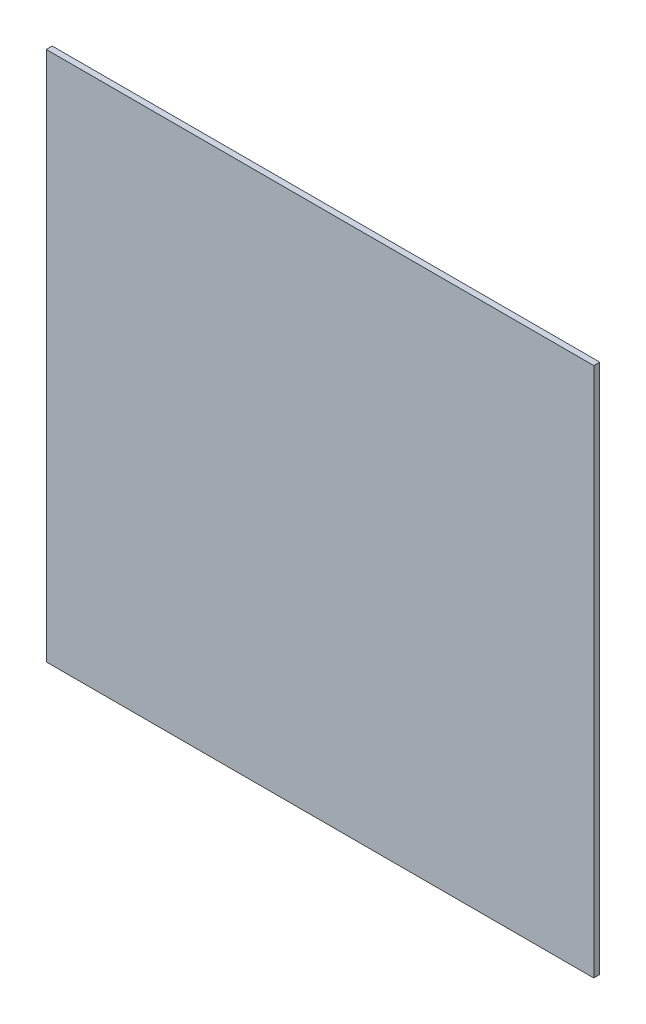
ISO-10303-21;
HEADER;
FILE_DESCRIPTION(('STEP AP214'),'2;1');
FILE_NAME('part.step','',(''),(''),'','','');
FILE_SCHEMA(('AUTOMOTIVE_DESIGN { 1 0 10303 214 1 1 1 1 }'));
ENDSEC;
DATA;
#1=APPLICATION_CONTEXT('core data for automotive mechanical design processes');
#2=APPLICATION_PROTOCOL_DEFINITION('international standard','automotive_design',2000,#1);
#3=PRODUCT_CONTEXT('',#1,'mechanical');
#4=PRODUCT('Part','Part','',(#3));
#5=PRODUCT_RELATED_PRODUCT_CATEGORY('part','',(#4));
#6=PRODUCT_DEFINITION_FORMATION('','',#4);
#7=PRODUCT_DEFINITION_CONTEXT('part definition',#1,'design');
#8=PRODUCT_DEFINITION('design','',#6,#7);
#9=PRODUCT_DEFINITION_SHAPE('','',#8);
#10=(LENGTH_UNIT() NAMED_UNIT(*) SI_UNIT(.MILLI.,.METRE.));
#11=(NAMED_UNIT(*) PLANE_ANGLE_UNIT() SI_UNIT($,.RADIAN.));
#12=(NAMED_UNIT(*) SI_UNIT($,.STERADIAN.) SOLID_ANGLE_UNIT());
#13=UNCERTAINTY_MEASURE_WITH_UNIT(LENGTH_MEASURE(1.E-05),#10,'distance_accuracy_value','');
#14=(GEOMETRIC_REPRESENTATION_CONTEXT(3) GLOBAL_UNCERTAINTY_ASSIGNED_CONTEXT((#13)) GLOBAL_UNIT_ASSIGNED_CONTEXT((#10,
#11,#12)) REPRESENTATION_CONTEXT('',''));
#15=CARTESIAN_POINT('',(0.,0.,0.));
#16=DIRECTION('',(0.,0.,1.));
#17=DIRECTION('',(1.,0.,0.));
#18=AXIS2_PLACEMENT_3D('',#15,#16,#17);
#19=CARTESIAN_POINT('',(48.,-46.5,1.05));
#20=DIRECTION('',(-1.,0.,0.));
#21=DIRECTION('',(0.,0.,1.));
#22=AXIS2_PLACEMENT_3D('',#19,#20,#21);
#23=PLANE('',#22);
#24=DIRECTION('',(0.,1.,0.));
#25=VECTOR('',#24,1.);
#26=CARTESIAN_POINT('',(48.,-46.5,0.));
#27=LINE('',#26,#25);
#28=CARTESIAN_POINT('',(48.,-46.5,0.));
#29=VERTEX_POINT('',#28);
#30=CARTESIAN_POINT('',(48.,46.5,0.));
#31=VERTEX_POINT('',#30);
#32=EDGE_CURVE('E98',#29,#31,#27,.T.);
#33=ORIENTED_EDGE('',*,*,#32,.T.);
#34=DIRECTION('',(0.,0.,-1.));
#35=VECTOR('',#34,1.);
#36=CARTESIAN_POINT('',(48.,46.5,1.05));
#37=LINE('',#36,#35);
#38=CARTESIAN_POINT('',(48.,46.5,1.05));
#39=VERTEX_POINT('',#38);
#40=EDGE_CURVE('E11',#39,#31,#37,.T.);
#41=ORIENTED_EDGE('',*,*,#40,.F.);
#42=DIRECTION('',(0.,1.,0.));
#43=VECTOR('',#42,1.);
#44=CARTESIAN_POINT('',(48.,-46.5,1.05));
#45=LINE('',#44,#43);
#46=CARTESIAN_POINT('',(48.,-46.5,1.05));
#47=VERTEX_POINT('',#46);
#48=EDGE_CURVE('E86',#47,#39,#45,.T.);
#49=ORIENTED_EDGE('',*,*,#48,.F.);
#50=DIRECTION('',(0.,0.,-1.));
#51=VECTOR('',#50,1.);
#52=CARTESIAN_POINT('',(48.,-46.5,1.05));
#53=LINE('',#52,#51);
#54=EDGE_CURVE('E94',#47,#29,#53,.T.);
#55=ORIENTED_EDGE('',*,*,#54,.T.);
#56=EDGE_LOOP('',(#33,#41,#49,#55));
#57=FACE_BOUND('',#56,.T.);
#58=ADVANCED_FACE('F35',(#57),#23,.F.);
#59=CARTESIAN_POINT('',(-48.,46.5,1.05));
#60=DIRECTION('',(0.,-1.,0.));
#61=DIRECTION('',(0.,0.,-1.));
#62=AXIS2_PLACEMENT_3D('',#59,#60,#61);
#63=PLANE('',#62);
#64=DIRECTION('',(-1.,0.,0.));
#65=VECTOR('',#64,1.);
#66=CARTESIAN_POINT('',(-48.,46.5,0.));
#67=LINE('',#66,#65);
#68=CARTESIAN_POINT('',(-48.,46.5,0.));
#69=VERTEX_POINT('',#68);
#70=EDGE_CURVE('E90',#31,#69,#67,.T.);
#71=ORIENTED_EDGE('',*,*,#70,.T.);
#72=DIRECTION('',(0.,0.,-1.));
#73=VECTOR('',#72,1.);
#74=CARTESIAN_POINT('',(-48.,46.5,1.05));
#75=LINE('',#74,#73);
#76=CARTESIAN_POINT('',(-48.,46.5,1.05));
#77=VERTEX_POINT('',#76);
#78=EDGE_CURVE('E43',#77,#69,#75,.T.);
#79=ORIENTED_EDGE('',*,*,#78,.F.);
#80=DIRECTION('',(-1.,0.,0.));
#81=VECTOR('',#80,1.);
#82=CARTESIAN_POINT('',(-48.,46.5,1.05));
#83=LINE('',#82,#81);
#84=EDGE_CURVE('E81',#39,#77,#83,.T.);
#85=ORIENTED_EDGE('',*,*,#84,.F.);
#86=ORIENTED_EDGE('',*,*,#40,.T.);
#87=EDGE_LOOP('',(#71,#79,#85,#86));
#88=FACE_BOUND('',#87,.T.);
#89=ADVANCED_FACE('F89',(#88),#63,.F.);
#90=CARTESIAN_POINT('',(-48.,-46.5,1.05));
#91=DIRECTION('',(1.,0.,0.));
#92=DIRECTION('',(0.,0.,-1.));
#93=AXIS2_PLACEMENT_3D('',#90,#91,#92);
#94=PLANE('',#93);
#95=DIRECTION('',(0.,-1.,0.));
#96=VECTOR('',#95,1.);
#97=CARTESIAN_POINT('',(-48.,-46.5,0.));
#98=LINE('',#97,#96);
#99=CARTESIAN_POINT('',(-48.,-46.5,0.));
#100=VERTEX_POINT('',#99);
#101=EDGE_CURVE('E68',#69,#100,#98,.T.);
#102=ORIENTED_EDGE('',*,*,#101,.T.);
#103=DIRECTION('',(0.,0.,-1.));
#104=VECTOR('',#103,1.);
#105=CARTESIAN_POINT('',(-48.,-46.5,1.05));
#106=LINE('',#105,#104);
#107=CARTESIAN_POINT('',(-48.,-46.5,1.05));
#108=VERTEX_POINT('',#107);
#109=EDGE_CURVE('E91',#108,#100,#106,.T.);
#110=ORIENTED_EDGE('',*,*,#109,.F.);
#111=DIRECTION('',(0.,-1.,0.));
#112=VECTOR('',#111,1.);
#113=CARTESIAN_POINT('',(-48.,-46.5,1.05));
#114=LINE('',#113,#112);
#115=EDGE_CURVE('E84',#77,#108,#114,.T.);
#116=ORIENTED_EDGE('',*,*,#115,.F.);
#117=ORIENTED_EDGE('',*,*,#78,.T.);
#118=EDGE_LOOP('',(#102,#110,#116,#117));
#119=FACE_BOUND('',#118,.T.);
#120=ADVANCED_FACE('F92',(#119),#94,.F.);
#121=CARTESIAN_POINT('',(-48.,-46.5,1.05));
#122=DIRECTION('',(0.,1.,0.));
#123=DIRECTION('',(0.,0.,1.));
#124=AXIS2_PLACEMENT_3D('',#121,#122,#123);
#125=PLANE('',#124);
#126=DIRECTION('',(1.,0.,0.));
#127=VECTOR('',#126,1.);
#128=CARTESIAN_POINT('',(-48.,-46.5,0.));
#129=LINE('',#128,#127);
#130=EDGE_CURVE('E74',#100,#29,#129,.T.);
#131=ORIENTED_EDGE('',*,*,#130,.T.);
#132=ORIENTED_EDGE('',*,*,#54,.F.);
#133=DIRECTION('',(1.,0.,0.));
#134=VECTOR('',#133,1.);
#135=CARTESIAN_POINT('',(-48.,-46.5,1.05));
#136=LINE('',#135,#134);
#137=EDGE_CURVE('E51',#108,#47,#136,.T.);
#138=ORIENTED_EDGE('',*,*,#137,.F.);
#139=ORIENTED_EDGE('',*,*,#109,.T.);
#140=EDGE_LOOP('',(#131,#132,#138,#139));
#141=FACE_BOUND('',#140,.T.);
#142=ADVANCED_FACE('F105',(#141),#125,.F.);
#143=CARTESIAN_POINT('',(0.,0.,1.05));
#144=DIRECTION('',(0.,0.,-1.));
#145=DIRECTION('',(-1.,0.,0.));
#146=AXIS2_PLACEMENT_3D('',#143,#144,#145);
#147=PLANE('',#146);
#148=ORIENTED_EDGE('',*,*,#48,.T.);
#149=ORIENTED_EDGE('',*,*,#84,.T.);
#150=ORIENTED_EDGE('',*,*,#115,.T.);
#151=ORIENTED_EDGE('',*,*,#137,.T.);
#152=EDGE_LOOP('',(#148,#149,#150,#151));
#153=FACE_BOUND('',#152,.T.);
#154=ADVANCED_FACE('F82',(#153),#147,.F.);
#155=CARTESIAN_POINT('',(0.,0.,0.));
#156=DIRECTION('',(0.,0.,-1.));
#157=DIRECTION('',(-1.,0.,0.));
#158=AXIS2_PLACEMENT_3D('',#155,#156,#157);
#159=PLANE('',#158);
#160=ORIENTED_EDGE('',*,*,#32,.F.);
#161=ORIENTED_EDGE('',*,*,#130,.F.);
#162=ORIENTED_EDGE('',*,*,#101,.F.);
#163=ORIENTED_EDGE('',*,*,#70,.F.);
#164=EDGE_LOOP('',(#160,#161,#162,#163));
#165=FACE_BOUND('',#164,.T.);
#166=ADVANCED_FACE('F108',(#165),#159,.T.);
#167=CLOSED_SHELL('',(#58,#89,#120,#142,#154,#166));
#168=MANIFOLD_SOLID_BREP('B2',#167);
#169=ADVANCED_BREP_SHAPE_REPRESENTATION('',(#18,#168),#14);
#170=SHAPE_DEFINITION_REPRESENTATION(#9,#169);
ENDSEC;
END-ISO-10303-21;
